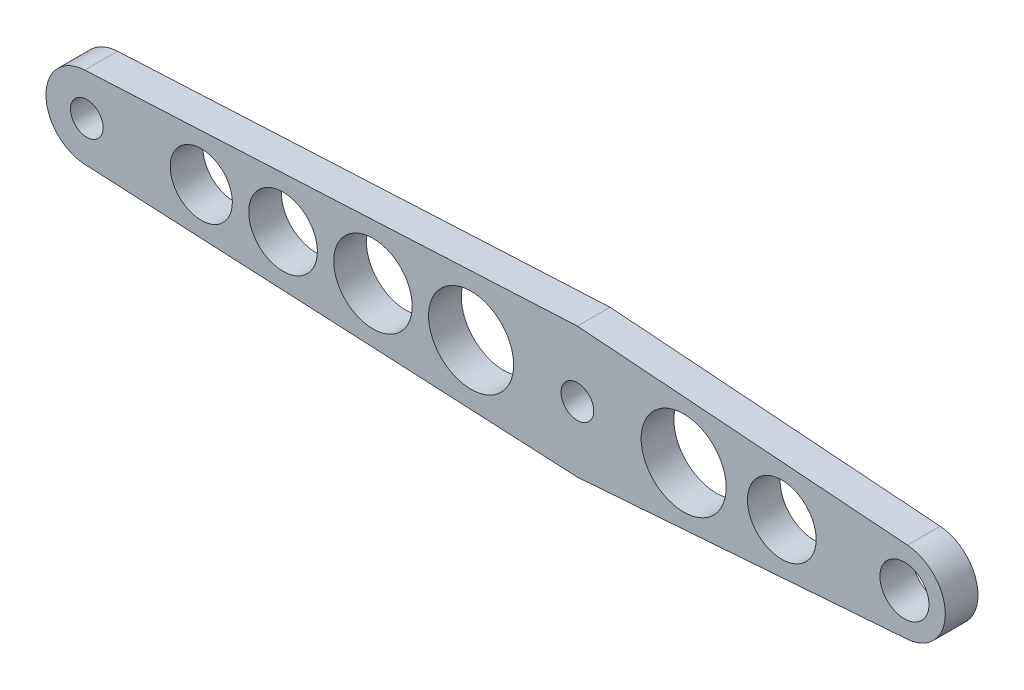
ISO-10303-21;
HEADER;
FILE_DESCRIPTION(('STEP AP214'),'2;1');
FILE_NAME('part.step','',(''),(''),'','','');
FILE_SCHEMA(('AUTOMOTIVE_DESIGN { 1 0 10303 214 1 1 1 1 }'));
ENDSEC;
DATA;
#1=APPLICATION_CONTEXT('core data for automotive mechanical design processes');
#2=APPLICATION_PROTOCOL_DEFINITION('international standard','automotive_design',2000,#1);
#3=PRODUCT_CONTEXT('',#1,'mechanical');
#4=PRODUCT('Part','Part','',(#3));
#5=PRODUCT_RELATED_PRODUCT_CATEGORY('part','',(#4));
#6=PRODUCT_DEFINITION_FORMATION('','',#4);
#7=PRODUCT_DEFINITION_CONTEXT('part definition',#1,'design');
#8=PRODUCT_DEFINITION('design','',#6,#7);
#9=PRODUCT_DEFINITION_SHAPE('','',#8);
#10=(LENGTH_UNIT() NAMED_UNIT(*) SI_UNIT(.MILLI.,.METRE.));
#11=(NAMED_UNIT(*) PLANE_ANGLE_UNIT() SI_UNIT($,.RADIAN.));
#12=(NAMED_UNIT(*) SI_UNIT($,.STERADIAN.) SOLID_ANGLE_UNIT());
#13=UNCERTAINTY_MEASURE_WITH_UNIT(LENGTH_MEASURE(1.E-05),#10,'distance_accuracy_value','');
#14=(GEOMETRIC_REPRESENTATION_CONTEXT(3) GLOBAL_UNCERTAINTY_ASSIGNED_CONTEXT((#13)) GLOBAL_UNIT_ASSIGNED_CONTEXT((#10,
#11,#12)) REPRESENTATION_CONTEXT('',''));
#15=CARTESIAN_POINT('',(0.,0.,0.));
#16=DIRECTION('',(0.,0.,1.));
#17=DIRECTION('',(1.,0.,0.));
#18=AXIS2_PLACEMENT_3D('',#15,#16,#17);
#19=CARTESIAN_POINT('',(-30.,0.,2.));
#20=DIRECTION('',(0.,0.,1.));
#21=DIRECTION('',(1.,0.,0.));
#22=AXIS2_PLACEMENT_3D('',#19,#20,#21);
#23=PLANE('',#22);
#24=CARTESIAN_POINT('',(12.5,0.,2.));
#25=DIRECTION('',(0.,0.,1.));
#26=DIRECTION('',(1.,0.,0.));
#27=AXIS2_PLACEMENT_3D('',#24,#25,#26);
#28=CIRCLE('',#27,2.1);
#29=CARTESIAN_POINT('',(14.6,0.,2.));
#30=VERTEX_POINT('',#29);
#31=EDGE_CURVE('E209',#30,#30,#28,.T.);
#32=ORIENTED_EDGE('',*,*,#31,.F.);
#33=EDGE_LOOP('',(#32));
#34=FACE_BOUND('',#33,.T.);
#35=CARTESIAN_POINT('',(-6.5,0.,2.));
#36=DIRECTION('',(0.,0.,1.));
#37=DIRECTION('',(1.,0.,0.));
#38=AXIS2_PLACEMENT_3D('',#35,#36,#37);
#39=CIRCLE('',#38,2.6);
#40=CARTESIAN_POINT('',(-3.9,0.,2.));
#41=VERTEX_POINT('',#40);
#42=EDGE_CURVE('E221',#41,#41,#39,.T.);
#43=ORIENTED_EDGE('',*,*,#42,.F.);
#44=EDGE_LOOP('',(#43));
#45=FACE_BOUND('',#44,.T.);
#46=CARTESIAN_POINT('',(-18.,0.,2.));
#47=DIRECTION('',(0.,0.,1.));
#48=DIRECTION('',(1.,0.,0.));
#49=AXIS2_PLACEMENT_3D('',#46,#47,#48);
#50=CIRCLE('',#49,2.1);
#51=CARTESIAN_POINT('',(-15.9,0.,2.));
#52=VERTEX_POINT('',#51);
#53=EDGE_CURVE('E233',#52,#52,#50,.T.);
#54=ORIENTED_EDGE('',*,*,#53,.F.);
#55=EDGE_LOOP('',(#54));
#56=FACE_BOUND('',#55,.T.);
#57=CARTESIAN_POINT('',(-30.,0.,2.));
#58=DIRECTION('',(0.,0.,1.));
#59=DIRECTION('',(1.,0.,0.));
#60=AXIS2_PLACEMENT_3D('',#57,#58,#59);
#61=CIRCLE('',#60,1.);
#62=CARTESIAN_POINT('',(-29.,0.,2.));
#63=VERTEX_POINT('',#62);
#64=EDGE_CURVE('E245',#63,#63,#61,.T.);
#65=ORIENTED_EDGE('',*,*,#64,.F.);
#66=EDGE_LOOP('',(#65));
#67=FACE_BOUND('',#66,.T.);
#68=CARTESIAN_POINT('',(-30.,0.,2.));
#69=DIRECTION('',(0.,0.,1.));
#70=DIRECTION('',(1.,0.,0.));
#71=AXIS2_PLACEMENT_3D('',#68,#69,#70);
#72=CIRCLE('',#71,2.5);
#73=CARTESIAN_POINT('',(-30.1245858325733,2.49689374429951,2.));
#74=VERTEX_POINT('',#73);
#75=CARTESIAN_POINT('',(-30.1245858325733,-2.49689374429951,2.));
#76=VERTEX_POINT('',#75);
#77=EDGE_CURVE('E129',#74,#76,#72,.T.);
#78=ORIENTED_EDGE('',*,*,#77,.T.);
#79=DIRECTION('',(0.998757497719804,-0.0498343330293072,0.));
#80=VECTOR('',#79,1.);
#81=CARTESIAN_POINT('',(-30.1245858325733,-2.49689374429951,2.));
#82=LINE('',#81,#80);
#83=CARTESIAN_POINT('',(0.,-4.,2.));
#84=VERTEX_POINT('',#83);
#85=EDGE_CURVE('E87',#76,#84,#82,.T.);
#86=ORIENTED_EDGE('',*,*,#85,.T.);
#87=DIRECTION('',(0.997225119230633,0.0744450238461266,0.));
#88=VECTOR('',#87,1.);
#89=CARTESIAN_POINT('',(0.,-4.,2.));
#90=LINE('',#89,#88);
#91=CARTESIAN_POINT('',(20.1861125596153,-2.49306279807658,2.));
#92=VERTEX_POINT('',#91);
#93=EDGE_CURVE('E100',#84,#92,#90,.T.);
#94=ORIENTED_EDGE('',*,*,#93,.T.);
#95=CARTESIAN_POINT('',(20.,0.,2.));
#96=DIRECTION('',(0.,0.,1.));
#97=DIRECTION('',(-1.,0.,0.));
#98=AXIS2_PLACEMENT_3D('',#95,#96,#97);
#99=CIRCLE('',#98,2.5);
#100=CARTESIAN_POINT('',(20.1861125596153,2.49306279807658,2.));
#101=VERTEX_POINT('',#100);
#102=EDGE_CURVE('E94',#92,#101,#99,.T.);
#103=ORIENTED_EDGE('',*,*,#102,.T.);
#104=DIRECTION('',(-0.997225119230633,0.0744450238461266,0.));
#105=VECTOR('',#104,1.);
#106=CARTESIAN_POINT('',(0.,4.,2.));
#107=LINE('',#106,#105);
#108=CARTESIAN_POINT('',(0.,4.,2.));
#109=VERTEX_POINT('',#108);
#110=EDGE_CURVE('E98',#101,#109,#107,.T.);
#111=ORIENTED_EDGE('',*,*,#110,.T.);
#112=DIRECTION('',(-0.998757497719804,-0.0498343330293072,0.));
#113=VECTOR('',#112,1.);
#114=CARTESIAN_POINT('',(-30.1245858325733,2.49689374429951,2.));
#115=LINE('',#114,#113);
#116=EDGE_CURVE('E50',#109,#74,#115,.T.);
#117=ORIENTED_EDGE('',*,*,#116,.T.);
#118=EDGE_LOOP('',(#78,#86,#94,#103,#111,#117));
#119=FACE_BOUND('',#118,.T.);
#120=CARTESIAN_POINT('',(0.,0.,2.));
#121=DIRECTION('',(0.,0.,1.));
#122=DIRECTION('',(1.,0.,0.));
#123=AXIS2_PLACEMENT_3D('',#120,#121,#122);
#124=CIRCLE('',#123,1.);
#125=CARTESIAN_POINT('',(1.,0.,2.));
#126=VERTEX_POINT('',#125);
#127=EDGE_CURVE('E122',#126,#126,#124,.T.);
#128=ORIENTED_EDGE('',*,*,#127,.F.);
#129=EDGE_LOOP('',(#128));
#130=FACE_BOUND('',#129,.T.);
#131=CARTESIAN_POINT('',(-23.,0.,2.));
#132=DIRECTION('',(0.,0.,1.));
#133=DIRECTION('',(1.,0.,0.));
#134=AXIS2_PLACEMENT_3D('',#131,#132,#133);
#135=CIRCLE('',#134,1.9);
#136=CARTESIAN_POINT('',(-21.1,0.,2.));
#137=VERTEX_POINT('',#136);
#138=EDGE_CURVE('E239',#137,#137,#135,.T.);
#139=ORIENTED_EDGE('',*,*,#138,.F.);
#140=EDGE_LOOP('',(#139));
#141=FACE_BOUND('',#140,.T.);
#142=CARTESIAN_POINT('',(-12.5,0.,2.));
#143=DIRECTION('',(0.,0.,1.));
#144=DIRECTION('',(1.,0.,0.));
#145=AXIS2_PLACEMENT_3D('',#142,#143,#144);
#146=CIRCLE('',#145,2.4);
#147=CARTESIAN_POINT('',(-10.1,0.,2.));
#148=VERTEX_POINT('',#147);
#149=EDGE_CURVE('E227',#148,#148,#146,.T.);
#150=ORIENTED_EDGE('',*,*,#149,.F.);
#151=EDGE_LOOP('',(#150));
#152=FACE_BOUND('',#151,.T.);
#153=CARTESIAN_POINT('',(6.5,0.,2.));
#154=DIRECTION('',(0.,0.,1.));
#155=DIRECTION('',(1.,0.,0.));
#156=AXIS2_PLACEMENT_3D('',#153,#154,#155);
#157=CIRCLE('',#156,2.6);
#158=CARTESIAN_POINT('',(9.1,0.,2.));
#159=VERTEX_POINT('',#158);
#160=EDGE_CURVE('E215',#159,#159,#157,.T.);
#161=ORIENTED_EDGE('',*,*,#160,.F.);
#162=EDGE_LOOP('',(#161));
#163=FACE_BOUND('',#162,.T.);
#164=CARTESIAN_POINT('',(20.,0.,2.));
#165=DIRECTION('',(0.,0.,1.));
#166=DIRECTION('',(1.,0.,0.));
#167=AXIS2_PLACEMENT_3D('',#164,#165,#166);
#168=CIRCLE('',#167,1.5);
#169=CARTESIAN_POINT('',(21.5,0.,2.));
#170=VERTEX_POINT('',#169);
#171=EDGE_CURVE('E200',#170,#170,#168,.T.);
#172=ORIENTED_EDGE('',*,*,#171,.F.);
#173=EDGE_LOOP('',(#172));
#174=FACE_BOUND('',#173,.T.);
#175=ADVANCED_FACE('F33',(#34,#45,#56,#67,#119,#130,#141,#152,#163,#174),#23,.T.);
#176=CARTESIAN_POINT('',(-30.,0.,0.));
#177=DIRECTION('',(0.,0.,1.));
#178=DIRECTION('',(1.,0.,0.));
#179=AXIS2_PLACEMENT_3D('',#176,#177,#178);
#180=PLANE('',#179);
#181=CARTESIAN_POINT('',(-30.,0.,0.));
#182=DIRECTION('',(0.,0.,1.));
#183=DIRECTION('',(1.,0.,0.));
#184=AXIS2_PLACEMENT_3D('',#181,#182,#183);
#185=CIRCLE('',#184,2.5);
#186=CARTESIAN_POINT('',(-30.1245858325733,2.49689374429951,0.));
#187=VERTEX_POINT('',#186);
#188=CARTESIAN_POINT('',(-30.1245858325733,-2.49689374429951,0.));
#189=VERTEX_POINT('',#188);
#190=EDGE_CURVE('E118',#187,#189,#185,.T.);
#191=ORIENTED_EDGE('',*,*,#190,.F.);
#192=DIRECTION('',(-0.998757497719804,-0.0498343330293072,0.));
#193=VECTOR('',#192,1.);
#194=CARTESIAN_POINT('',(-30.1245858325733,2.49689374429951,0.));
#195=LINE('',#194,#193);
#196=CARTESIAN_POINT('',(0.,4.,0.));
#197=VERTEX_POINT('',#196);
#198=EDGE_CURVE('E79',#197,#187,#195,.T.);
#199=ORIENTED_EDGE('',*,*,#198,.F.);
#200=DIRECTION('',(-0.997225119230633,0.0744450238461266,0.));
#201=VECTOR('',#200,1.);
#202=CARTESIAN_POINT('',(0.,4.,0.));
#203=LINE('',#202,#201);
#204=CARTESIAN_POINT('',(20.1861125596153,2.49306279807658,0.));
#205=VERTEX_POINT('',#204);
#206=EDGE_CURVE('E73',#205,#197,#203,.T.);
#207=ORIENTED_EDGE('',*,*,#206,.F.);
#208=CARTESIAN_POINT('',(20.,0.,0.));
#209=DIRECTION('',(0.,0.,1.));
#210=DIRECTION('',(-1.,0.,0.));
#211=AXIS2_PLACEMENT_3D('',#208,#209,#210);
#212=CIRCLE('',#211,2.5);
#213=CARTESIAN_POINT('',(20.1861125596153,-2.49306279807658,0.));
#214=VERTEX_POINT('',#213);
#215=EDGE_CURVE('E108',#214,#205,#212,.T.);
#216=ORIENTED_EDGE('',*,*,#215,.F.);
#217=DIRECTION('',(0.997225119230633,0.0744450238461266,0.));
#218=VECTOR('',#217,1.);
#219=CARTESIAN_POINT('',(0.,-4.,0.));
#220=LINE('',#219,#218);
#221=CARTESIAN_POINT('',(0.,-4.,0.));
#222=VERTEX_POINT('',#221);
#223=EDGE_CURVE('E124',#222,#214,#220,.T.);
#224=ORIENTED_EDGE('',*,*,#223,.F.);
#225=DIRECTION('',(0.998757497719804,-0.0498343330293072,0.));
#226=VECTOR('',#225,1.);
#227=CARTESIAN_POINT('',(-30.1245858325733,-2.49689374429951,0.));
#228=LINE('',#227,#226);
#229=EDGE_CURVE('E121',#189,#222,#228,.T.);
#230=ORIENTED_EDGE('',*,*,#229,.F.);
#231=EDGE_LOOP('',(#191,#199,#207,#216,#224,#230));
#232=FACE_BOUND('',#231,.T.);
#233=CARTESIAN_POINT('',(0.,0.,0.));
#234=DIRECTION('',(0.,0.,1.));
#235=DIRECTION('',(1.,0.,0.));
#236=AXIS2_PLACEMENT_3D('',#233,#234,#235);
#237=CIRCLE('',#236,1.);
#238=CARTESIAN_POINT('',(1.,0.,0.));
#239=VERTEX_POINT('',#238);
#240=EDGE_CURVE('E248',#239,#239,#237,.T.);
#241=ORIENTED_EDGE('',*,*,#240,.T.);
#242=EDGE_LOOP('',(#241));
#243=FACE_BOUND('',#242,.T.);
#244=CARTESIAN_POINT('',(-30.,0.,0.));
#245=DIRECTION('',(0.,0.,1.));
#246=DIRECTION('',(1.,0.,0.));
#247=AXIS2_PLACEMENT_3D('',#244,#245,#246);
#248=CIRCLE('',#247,1.);
#249=CARTESIAN_POINT('',(-29.,0.,0.));
#250=VERTEX_POINT('',#249);
#251=EDGE_CURVE('E242',#250,#250,#248,.T.);
#252=ORIENTED_EDGE('',*,*,#251,.T.);
#253=EDGE_LOOP('',(#252));
#254=FACE_BOUND('',#253,.T.);
#255=CARTESIAN_POINT('',(-23.,0.,0.));
#256=DIRECTION('',(0.,0.,1.));
#257=DIRECTION('',(1.,0.,0.));
#258=AXIS2_PLACEMENT_3D('',#255,#256,#257);
#259=CIRCLE('',#258,1.9);
#260=CARTESIAN_POINT('',(-21.1,0.,0.));
#261=VERTEX_POINT('',#260);
#262=EDGE_CURVE('E236',#261,#261,#259,.T.);
#263=ORIENTED_EDGE('',*,*,#262,.T.);
#264=EDGE_LOOP('',(#263));
#265=FACE_BOUND('',#264,.T.);
#266=CARTESIAN_POINT('',(-18.,0.,0.));
#267=DIRECTION('',(0.,0.,1.));
#268=DIRECTION('',(1.,0.,0.));
#269=AXIS2_PLACEMENT_3D('',#266,#267,#268);
#270=CIRCLE('',#269,2.1);
#271=CARTESIAN_POINT('',(-15.9,0.,0.));
#272=VERTEX_POINT('',#271);
#273=EDGE_CURVE('E230',#272,#272,#270,.T.);
#274=ORIENTED_EDGE('',*,*,#273,.T.);
#275=EDGE_LOOP('',(#274));
#276=FACE_BOUND('',#275,.T.);
#277=CARTESIAN_POINT('',(-12.5,0.,0.));
#278=DIRECTION('',(0.,0.,1.));
#279=DIRECTION('',(1.,0.,0.));
#280=AXIS2_PLACEMENT_3D('',#277,#278,#279);
#281=CIRCLE('',#280,2.4);
#282=CARTESIAN_POINT('',(-10.1,0.,0.));
#283=VERTEX_POINT('',#282);
#284=EDGE_CURVE('E224',#283,#283,#281,.T.);
#285=ORIENTED_EDGE('',*,*,#284,.T.);
#286=EDGE_LOOP('',(#285));
#287=FACE_BOUND('',#286,.T.);
#288=CARTESIAN_POINT('',(-6.5,0.,0.));
#289=DIRECTION('',(0.,0.,1.));
#290=DIRECTION('',(1.,0.,0.));
#291=AXIS2_PLACEMENT_3D('',#288,#289,#290);
#292=CIRCLE('',#291,2.6);
#293=CARTESIAN_POINT('',(-3.9,0.,0.));
#294=VERTEX_POINT('',#293);
#295=EDGE_CURVE('E218',#294,#294,#292,.T.);
#296=ORIENTED_EDGE('',*,*,#295,.T.);
#297=EDGE_LOOP('',(#296));
#298=FACE_BOUND('',#297,.T.);
#299=CARTESIAN_POINT('',(6.5,0.,0.));
#300=DIRECTION('',(0.,0.,1.));
#301=DIRECTION('',(1.,0.,0.));
#302=AXIS2_PLACEMENT_3D('',#299,#300,#301);
#303=CIRCLE('',#302,2.6);
#304=CARTESIAN_POINT('',(9.1,0.,0.));
#305=VERTEX_POINT('',#304);
#306=EDGE_CURVE('E212',#305,#305,#303,.T.);
#307=ORIENTED_EDGE('',*,*,#306,.T.);
#308=EDGE_LOOP('',(#307));
#309=FACE_BOUND('',#308,.T.);
#310=CARTESIAN_POINT('',(12.5,0.,0.));
#311=DIRECTION('',(0.,0.,1.));
#312=DIRECTION('',(1.,0.,0.));
#313=AXIS2_PLACEMENT_3D('',#310,#311,#312);
#314=CIRCLE('',#313,2.1);
#315=CARTESIAN_POINT('',(14.6,0.,0.));
#316=VERTEX_POINT('',#315);
#317=EDGE_CURVE('E206',#316,#316,#314,.T.);
#318=ORIENTED_EDGE('',*,*,#317,.T.);
#319=EDGE_LOOP('',(#318));
#320=FACE_BOUND('',#319,.T.);
#321=CARTESIAN_POINT('',(20.,0.,0.));
#322=DIRECTION('',(0.,0.,1.));
#323=DIRECTION('',(1.,0.,0.));
#324=AXIS2_PLACEMENT_3D('',#321,#322,#323);
#325=CIRCLE('',#324,1.5);
#326=CARTESIAN_POINT('',(21.5,0.,0.));
#327=VERTEX_POINT('',#326);
#328=EDGE_CURVE('E203',#327,#327,#325,.T.);
#329=ORIENTED_EDGE('',*,*,#328,.T.);
#330=EDGE_LOOP('',(#329));
#331=FACE_BOUND('',#330,.T.);
#332=ADVANCED_FACE('F138',(#232,#243,#254,#265,#276,#287,#298,#309,#320,#331),#180,.F.);
#333=CARTESIAN_POINT('',(-30.,0.,2.));
#334=DIRECTION('',(0.,0.,-1.));
#335=DIRECTION('',(-1.,0.,0.));
#336=AXIS2_PLACEMENT_3D('',#333,#334,#335);
#337=CYLINDRICAL_SURFACE('',#336,2.5);
#338=ORIENTED_EDGE('',*,*,#190,.T.);
#339=DIRECTION('',(0.,0.,-1.));
#340=VECTOR('',#339,1.);
#341=CARTESIAN_POINT('',(-30.1245858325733,-2.49689374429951,2.));
#342=LINE('',#341,#340);
#343=EDGE_CURVE('E11',#76,#189,#342,.T.);
#344=ORIENTED_EDGE('',*,*,#343,.F.);
#345=ORIENTED_EDGE('',*,*,#77,.F.);
#346=DIRECTION('',(0.,0.,-1.));
#347=VECTOR('',#346,1.);
#348=CARTESIAN_POINT('',(-30.1245858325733,2.49689374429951,2.));
#349=LINE('',#348,#347);
#350=EDGE_CURVE('E114',#74,#187,#349,.T.);
#351=ORIENTED_EDGE('',*,*,#350,.T.);
#352=EDGE_LOOP('',(#338,#344,#345,#351));
#353=FACE_BOUND('',#352,.T.);
#354=ADVANCED_FACE('F35',(#353),#337,.T.);
#355=CARTESIAN_POINT('',(-30.1245858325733,-2.49689374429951,2.));
#356=DIRECTION('',(0.0498343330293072,0.998757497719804,0.));
#357=DIRECTION('',(-0.998757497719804,0.0498343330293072,0.));
#358=AXIS2_PLACEMENT_3D('',#355,#356,#357);
#359=PLANE('',#358);
#360=ORIENTED_EDGE('',*,*,#229,.T.);
#361=DIRECTION('',(0.,0.,-1.));
#362=VECTOR('',#361,1.);
#363=CARTESIAN_POINT('',(0.,-4.,2.));
#364=LINE('',#363,#362);
#365=EDGE_CURVE('E42',#84,#222,#364,.T.);
#366=ORIENTED_EDGE('',*,*,#365,.F.);
#367=ORIENTED_EDGE('',*,*,#85,.F.);
#368=ORIENTED_EDGE('',*,*,#343,.T.);
#369=EDGE_LOOP('',(#360,#366,#367,#368));
#370=FACE_BOUND('',#369,.T.);
#371=ADVANCED_FACE('F351',(#370),#359,.F.);
#372=CARTESIAN_POINT('',(0.,-4.,2.));
#373=DIRECTION('',(-0.0744450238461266,0.997225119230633,0.));
#374=DIRECTION('',(-0.997225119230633,-0.0744450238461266,0.));
#375=AXIS2_PLACEMENT_3D('',#372,#373,#374);
#376=PLANE('',#375);
#377=ORIENTED_EDGE('',*,*,#223,.T.);
#378=DIRECTION('',(0.,0.,-1.));
#379=VECTOR('',#378,1.);
#380=CARTESIAN_POINT('',(20.1861125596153,-2.49306279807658,2.));
#381=LINE('',#380,#379);
#382=EDGE_CURVE('E109',#92,#214,#381,.T.);
#383=ORIENTED_EDGE('',*,*,#382,.F.);
#384=ORIENTED_EDGE('',*,*,#93,.F.);
#385=ORIENTED_EDGE('',*,*,#365,.T.);
#386=EDGE_LOOP('',(#377,#383,#384,#385));
#387=FACE_BOUND('',#386,.T.);
#388=ADVANCED_FACE('F135',(#387),#376,.F.);
#389=CARTESIAN_POINT('',(20.,0.,2.));
#390=DIRECTION('',(0.,0.,-1.));
#391=DIRECTION('',(-1.,0.,0.));
#392=AXIS2_PLACEMENT_3D('',#389,#390,#391);
#393=CYLINDRICAL_SURFACE('',#392,2.5);
#394=ORIENTED_EDGE('',*,*,#215,.T.);
#395=DIRECTION('',(0.,0.,-1.));
#396=VECTOR('',#395,1.);
#397=CARTESIAN_POINT('',(20.1861125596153,2.49306279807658,2.));
#398=LINE('',#397,#396);
#399=EDGE_CURVE('E105',#101,#205,#398,.T.);
#400=ORIENTED_EDGE('',*,*,#399,.F.);
#401=ORIENTED_EDGE('',*,*,#102,.F.);
#402=ORIENTED_EDGE('',*,*,#382,.T.);
#403=EDGE_LOOP('',(#394,#400,#401,#402));
#404=FACE_BOUND('',#403,.T.);
#405=ADVANCED_FACE('F106',(#404),#393,.T.);
#406=CARTESIAN_POINT('',(0.,4.,2.));
#407=DIRECTION('',(-0.0744450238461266,-0.997225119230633,0.));
#408=DIRECTION('',(0.997225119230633,-0.0744450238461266,0.));
#409=AXIS2_PLACEMENT_3D('',#406,#407,#408);
#410=PLANE('',#409);
#411=ORIENTED_EDGE('',*,*,#206,.T.);
#412=DIRECTION('',(0.,0.,-1.));
#413=VECTOR('',#412,1.);
#414=CARTESIAN_POINT('',(0.,4.,2.));
#415=LINE('',#414,#413);
#416=EDGE_CURVE('E110',#109,#197,#415,.T.);
#417=ORIENTED_EDGE('',*,*,#416,.F.);
#418=ORIENTED_EDGE('',*,*,#110,.F.);
#419=ORIENTED_EDGE('',*,*,#399,.T.);
#420=EDGE_LOOP('',(#411,#417,#418,#419));
#421=FACE_BOUND('',#420,.T.);
#422=ADVANCED_FACE('F112',(#421),#410,.F.);
#423=CARTESIAN_POINT('',(-30.1245858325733,2.49689374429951,2.));
#424=DIRECTION('',(0.0498343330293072,-0.998757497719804,0.));
#425=DIRECTION('',(0.998757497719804,0.0498343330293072,0.));
#426=AXIS2_PLACEMENT_3D('',#423,#424,#425);
#427=PLANE('',#426);
#428=ORIENTED_EDGE('',*,*,#198,.T.);
#429=ORIENTED_EDGE('',*,*,#350,.F.);
#430=ORIENTED_EDGE('',*,*,#116,.F.);
#431=ORIENTED_EDGE('',*,*,#416,.T.);
#432=EDGE_LOOP('',(#428,#429,#430,#431));
#433=FACE_BOUND('',#432,.T.);
#434=ADVANCED_FACE('F143',(#433),#427,.F.);
#435=CARTESIAN_POINT('',(0.,0.,2.));
#436=DIRECTION('',(0.,0.,-1.));
#437=DIRECTION('',(-1.,0.,0.));
#438=AXIS2_PLACEMENT_3D('',#435,#436,#437);
#439=CYLINDRICAL_SURFACE('',#438,1.);
#440=ORIENTED_EDGE('',*,*,#127,.T.);
#441=EDGE_LOOP('',(#440));
#442=FACE_BOUND('',#441,.T.);
#443=ORIENTED_EDGE('',*,*,#240,.F.);
#444=EDGE_LOOP('',(#443));
#445=FACE_BOUND('',#444,.T.);
#446=ADVANCED_FACE('F145',(#442,#445),#439,.F.);
#447=CARTESIAN_POINT('',(-30.,0.,2.));
#448=DIRECTION('',(0.,0.,-1.));
#449=DIRECTION('',(-1.,0.,0.));
#450=AXIS2_PLACEMENT_3D('',#447,#448,#449);
#451=CYLINDRICAL_SURFACE('',#450,1.);
#452=ORIENTED_EDGE('',*,*,#64,.T.);
#453=EDGE_LOOP('',(#452));
#454=FACE_BOUND('',#453,.T.);
#455=ORIENTED_EDGE('',*,*,#251,.F.);
#456=EDGE_LOOP('',(#455));
#457=FACE_BOUND('',#456,.T.);
#458=ADVANCED_FACE('F151',(#454,#457),#451,.F.);
#459=CARTESIAN_POINT('',(-23.,0.,2.));
#460=DIRECTION('',(0.,0.,-1.));
#461=DIRECTION('',(-1.,0.,0.));
#462=AXIS2_PLACEMENT_3D('',#459,#460,#461);
#463=CYLINDRICAL_SURFACE('',#462,1.9);
#464=ORIENTED_EDGE('',*,*,#138,.T.);
#465=EDGE_LOOP('',(#464));
#466=FACE_BOUND('',#465,.T.);
#467=ORIENTED_EDGE('',*,*,#262,.F.);
#468=EDGE_LOOP('',(#467));
#469=FACE_BOUND('',#468,.T.);
#470=ADVANCED_FACE('F167',(#466,#469),#463,.F.);
#471=CARTESIAN_POINT('',(-18.,0.,2.));
#472=DIRECTION('',(0.,0.,-1.));
#473=DIRECTION('',(-1.,0.,0.));
#474=AXIS2_PLACEMENT_3D('',#471,#472,#473);
#475=CYLINDRICAL_SURFACE('',#474,2.1);
#476=ORIENTED_EDGE('',*,*,#53,.T.);
#477=EDGE_LOOP('',(#476));
#478=FACE_BOUND('',#477,.T.);
#479=ORIENTED_EDGE('',*,*,#273,.F.);
#480=EDGE_LOOP('',(#479));
#481=FACE_BOUND('',#480,.T.);
#482=ADVANCED_FACE('F171',(#478,#481),#475,.F.);
#483=CARTESIAN_POINT('',(-12.5,0.,2.));
#484=DIRECTION('',(0.,0.,-1.));
#485=DIRECTION('',(-1.,0.,0.));
#486=AXIS2_PLACEMENT_3D('',#483,#484,#485);
#487=CYLINDRICAL_SURFACE('',#486,2.4);
#488=ORIENTED_EDGE('',*,*,#149,.T.);
#489=EDGE_LOOP('',(#488));
#490=FACE_BOUND('',#489,.T.);
#491=ORIENTED_EDGE('',*,*,#284,.F.);
#492=EDGE_LOOP('',(#491));
#493=FACE_BOUND('',#492,.T.);
#494=ADVANCED_FACE('F175',(#490,#493),#487,.F.);
#495=CARTESIAN_POINT('',(-6.5,0.,2.));
#496=DIRECTION('',(0.,0.,-1.));
#497=DIRECTION('',(-1.,0.,0.));
#498=AXIS2_PLACEMENT_3D('',#495,#496,#497);
#499=CYLINDRICAL_SURFACE('',#498,2.6);
#500=ORIENTED_EDGE('',*,*,#42,.T.);
#501=EDGE_LOOP('',(#500));
#502=FACE_BOUND('',#501,.T.);
#503=ORIENTED_EDGE('',*,*,#295,.F.);
#504=EDGE_LOOP('',(#503));
#505=FACE_BOUND('',#504,.T.);
#506=ADVANCED_FACE('F179',(#502,#505),#499,.F.);
#507=CARTESIAN_POINT('',(6.5,0.,2.));
#508=DIRECTION('',(0.,0.,-1.));
#509=DIRECTION('',(-1.,0.,0.));
#510=AXIS2_PLACEMENT_3D('',#507,#508,#509);
#511=CYLINDRICAL_SURFACE('',#510,2.6);
#512=ORIENTED_EDGE('',*,*,#160,.T.);
#513=EDGE_LOOP('',(#512));
#514=FACE_BOUND('',#513,.T.);
#515=ORIENTED_EDGE('',*,*,#306,.F.);
#516=EDGE_LOOP('',(#515));
#517=FACE_BOUND('',#516,.T.);
#518=ADVANCED_FACE('F183',(#514,#517),#511,.F.);
#519=CARTESIAN_POINT('',(12.5,0.,2.));
#520=DIRECTION('',(0.,0.,-1.));
#521=DIRECTION('',(-1.,0.,0.));
#522=AXIS2_PLACEMENT_3D('',#519,#520,#521);
#523=CYLINDRICAL_SURFACE('',#522,2.1);
#524=ORIENTED_EDGE('',*,*,#31,.T.);
#525=EDGE_LOOP('',(#524));
#526=FACE_BOUND('',#525,.T.);
#527=ORIENTED_EDGE('',*,*,#317,.F.);
#528=EDGE_LOOP('',(#527));
#529=FACE_BOUND('',#528,.T.);
#530=ADVANCED_FACE('F187',(#526,#529),#523,.F.);
#531=CARTESIAN_POINT('',(20.,0.,2.));
#532=DIRECTION('',(0.,0.,-1.));
#533=DIRECTION('',(-1.,0.,0.));
#534=AXIS2_PLACEMENT_3D('',#531,#532,#533);
#535=CYLINDRICAL_SURFACE('',#534,1.5);
#536=ORIENTED_EDGE('',*,*,#171,.T.);
#537=EDGE_LOOP('',(#536));
#538=FACE_BOUND('',#537,.T.);
#539=ORIENTED_EDGE('',*,*,#328,.F.);
#540=EDGE_LOOP('',(#539));
#541=FACE_BOUND('',#540,.T.);
#542=ADVANCED_FACE('F191',(#538,#541),#535,.F.);
#543=CLOSED_SHELL('',(#175,#332,#354,#371,#388,#405,#422,#434,#446,#458,#470,#482,#494,#506,
#518,#530,#542));
#544=MANIFOLD_SOLID_BREP('B2',#543);
#545=ADVANCED_BREP_SHAPE_REPRESENTATION('',(#18,#544),#14);
#546=SHAPE_DEFINITION_REPRESENTATION(#9,#545);
ENDSEC;
END-ISO-10303-21;
